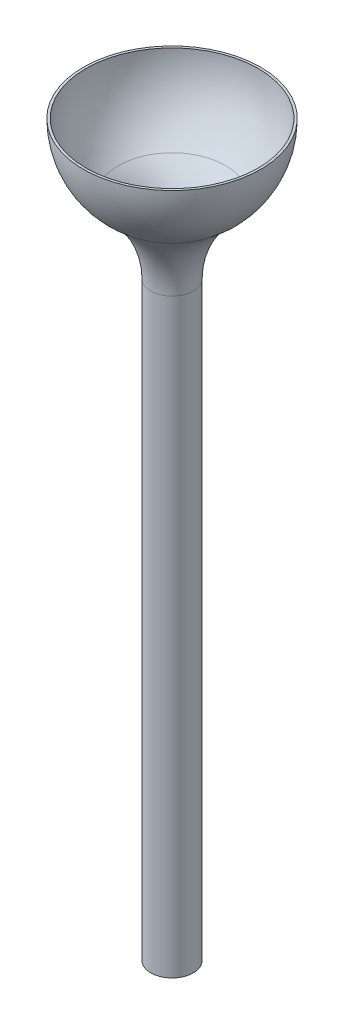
ISO-10303-21;
HEADER;
FILE_DESCRIPTION(('STEP AP214'),'2;1');
FILE_NAME('part.step','',(''),(''),'','','');
FILE_SCHEMA(('AUTOMOTIVE_DESIGN { 1 0 10303 214 1 1 1 1 }'));
ENDSEC;
DATA;
#1=APPLICATION_CONTEXT('core data for automotive mechanical design processes');
#2=APPLICATION_PROTOCOL_DEFINITION('international standard','automotive_design',2000,#1);
#3=PRODUCT_CONTEXT('',#1,'mechanical');
#4=PRODUCT('Part','Part','',(#3));
#5=PRODUCT_RELATED_PRODUCT_CATEGORY('part','',(#4));
#6=PRODUCT_DEFINITION_FORMATION('','',#4);
#7=PRODUCT_DEFINITION_CONTEXT('part definition',#1,'design');
#8=PRODUCT_DEFINITION('design','',#6,#7);
#9=PRODUCT_DEFINITION_SHAPE('','',#8);
#10=(LENGTH_UNIT() NAMED_UNIT(*) SI_UNIT(.MILLI.,.METRE.));
#11=(NAMED_UNIT(*) PLANE_ANGLE_UNIT() SI_UNIT($,.RADIAN.));
#12=(NAMED_UNIT(*) SI_UNIT($,.STERADIAN.) SOLID_ANGLE_UNIT());
#13=UNCERTAINTY_MEASURE_WITH_UNIT(LENGTH_MEASURE(1.E-05),#10,'distance_accuracy_value','');
#14=(GEOMETRIC_REPRESENTATION_CONTEXT(3) GLOBAL_UNCERTAINTY_ASSIGNED_CONTEXT((#13)) GLOBAL_UNIT_ASSIGNED_CONTEXT((#10,
#11,#12)) REPRESENTATION_CONTEXT('',''));
#15=CARTESIAN_POINT('',(0.,0.,0.));
#16=DIRECTION('',(0.,0.,1.));
#17=DIRECTION('',(1.,0.,0.));
#18=AXIS2_PLACEMENT_3D('',#15,#16,#17);
#19=CARTESIAN_POINT('',(0.,61.7690271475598,0.));
#20=DIRECTION('',(0.,1.,0.));
#21=DIRECTION('',(0.,0.,1.));
#22=AXIS2_PLACEMENT_3D('',#19,#20,#21);
#23=PLANE('',#22);
#24=CARTESIAN_POINT('',(0.,61.7690271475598,0.));
#25=DIRECTION('',(0.,-1.,0.));
#26=DIRECTION('',(0.,0.,-1.));
#27=AXIS2_PLACEMENT_3D('',#24,#25,#26);
#28=CIRCLE('',#27,7.3);
#29=CARTESIAN_POINT('',(0.,61.7690271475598,-7.3));
#30=VERTEX_POINT('',#29);
#31=EDGE_CURVE('E52',#30,#30,#28,.T.);
#32=ORIENTED_EDGE('',*,*,#31,.T.);
#33=EDGE_LOOP('',(#32));
#34=FACE_BOUND('',#33,.T.);
#35=CARTESIAN_POINT('',(0.,61.7690271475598,0.));
#36=DIRECTION('',(0.,-1.,0.));
#37=DIRECTION('',(0.,0.,-1.));
#38=AXIS2_PLACEMENT_3D('',#35,#36,#37);
#39=CIRCLE('',#38,7.5);
#40=CARTESIAN_POINT('',(0.,61.7690271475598,-7.5));
#41=VERTEX_POINT('',#40);
#42=EDGE_CURVE('E56',#41,#41,#39,.T.);
#43=ORIENTED_EDGE('',*,*,#42,.F.);
#44=EDGE_LOOP('',(#43));
#45=FACE_BOUND('',#44,.T.);
#46=ADVANCED_FACE('F36',(#34,#45),#23,.T.);
#47=CARTESIAN_POINT('',(0.,0.,0.));
#48=DIRECTION('',(0.,1.,0.));
#49=DIRECTION('',(0.,0.,1.));
#50=AXIS2_PLACEMENT_3D('',#47,#48,#49);
#51=PLANE('',#50);
#52=CARTESIAN_POINT('',(0.,0.,0.));
#53=DIRECTION('',(0.,-1.,0.));
#54=DIRECTION('',(0.,0.,-1.));
#55=AXIS2_PLACEMENT_3D('',#52,#53,#54);
#56=CIRCLE('',#55,1.6);
#57=CARTESIAN_POINT('',(0.,0.,-1.6));
#58=VERTEX_POINT('',#57);
#59=EDGE_CURVE('E10',#58,#58,#56,.T.);
#60=ORIENTED_EDGE('',*,*,#59,.F.);
#61=EDGE_LOOP('',(#60));
#62=FACE_BOUND('',#61,.T.);
#63=CARTESIAN_POINT('',(0.,0.,0.));
#64=DIRECTION('',(0.,-1.,0.));
#65=DIRECTION('',(0.,0.,-1.));
#66=AXIS2_PLACEMENT_3D('',#63,#64,#65);
#67=CIRCLE('',#66,1.8);
#68=CARTESIAN_POINT('',(0.,0.,-1.8));
#69=VERTEX_POINT('',#68);
#70=EDGE_CURVE('E55',#69,#69,#67,.T.);
#71=ORIENTED_EDGE('',*,*,#70,.T.);
#72=EDGE_LOOP('',(#71));
#73=FACE_BOUND('',#72,.T.);
#74=ADVANCED_FACE('F82',(#62,#73),#51,.F.);
#75=CARTESIAN_POINT('',(0.,61.7690271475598,0.));
#76=DIRECTION('',(0.,-1.,0.));
#77=DIRECTION('',(0.,0.,-1.));
#78=AXIS2_PLACEMENT_3D('',#75,#76,#77);
#79=CYLINDRICAL_SURFACE('',#78,1.6);
#80=ORIENTED_EDGE('',*,*,#59,.T.);
#81=EDGE_LOOP('',(#80));
#82=FACE_BOUND('',#81,.T.);
#83=CARTESIAN_POINT('',(0.,50.,0.));
#84=DIRECTION('',(0.,-1.,0.));
#85=DIRECTION('',(0.,0.,-1.));
#86=AXIS2_PLACEMENT_3D('',#83,#84,#85);
#87=CIRCLE('',#86,1.6);
#88=CARTESIAN_POINT('',(0.,50.,-1.6));
#89=VERTEX_POINT('',#88);
#90=EDGE_CURVE('E43',#89,#89,#87,.T.);
#91=ORIENTED_EDGE('',*,*,#90,.F.);
#92=EDGE_LOOP('',(#91));
#93=FACE_BOUND('',#92,.T.);
#94=ADVANCED_FACE('F87',(#82,#93),#79,.F.);
#95=CARTESIAN_POINT('',(0.,50.,0.));
#96=DIRECTION('',(0.,-1.,0.));
#97=DIRECTION('',(0.,0.,-1.));
#98=AXIS2_PLACEMENT_3D('',#95,#96,#97);
#99=TOROIDAL_SURFACE('',#98,9.29999999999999,7.7);
#100=ORIENTED_EDGE('',*,*,#90,.T.);
#101=EDGE_LOOP('',(#100));
#102=FACE_BOUND('',#101,.T.);
#103=CARTESIAN_POINT('',(0.,56.0414339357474,0.));
#104=DIRECTION('',(0.,-1.,0.));
#105=DIRECTION('',(0.,0.,-1.));
#106=AXIS2_PLACEMENT_3D('',#103,#104,#105);
#107=CIRCLE('',#106,4.52599999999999);
#108=CARTESIAN_POINT('',(0.,56.0414339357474,-4.52599999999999));
#109=VERTEX_POINT('',#108);
#110=EDGE_CURVE('E48',#109,#109,#107,.T.);
#111=ORIENTED_EDGE('',*,*,#110,.F.);
#112=EDGE_LOOP('',(#111));
#113=FACE_BOUND('',#112,.T.);
#114=ADVANCED_FACE('F93',(#102,#113),#99,.T.);
#115=CARTESIAN_POINT('',(0.,61.7690271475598,0.));
#116=DIRECTION('',(0.,-1.,0.));
#117=DIRECTION('',(1.,0.,0.));
#118=AXIS2_PLACEMENT_3D('',#115,#116,#117);
#119=SPHERICAL_SURFACE('',#118,7.3);
#120=ORIENTED_EDGE('',*,*,#110,.T.);
#121=EDGE_LOOP('',(#120));
#122=FACE_BOUND('',#121,.T.);
#123=ORIENTED_EDGE('',*,*,#31,.F.);
#124=EDGE_LOOP('',(#123));
#125=FACE_BOUND('',#124,.T.);
#126=ADVANCED_FACE('F91',(#122,#125),#119,.F.);
#127=CARTESIAN_POINT('',(0.,61.7690271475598,0.));
#128=DIRECTION('',(0.,-1.,0.));
#129=DIRECTION('',(0.,0.,-1.));
#130=AXIS2_PLACEMENT_3D('',#127,#128,#129);
#131=CYLINDRICAL_SURFACE('',#130,1.8);
#132=ORIENTED_EDGE('',*,*,#70,.F.);
#133=EDGE_LOOP('',(#132));
#134=FACE_BOUND('',#133,.T.);
#135=CARTESIAN_POINT('',(0.,50.,0.));
#136=DIRECTION('',(0.,-1.,0.));
#137=DIRECTION('',(0.,0.,-1.));
#138=AXIS2_PLACEMENT_3D('',#135,#136,#137);
#139=CIRCLE('',#138,1.79999999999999);
#140=CARTESIAN_POINT('',(0.,50.,-1.79999999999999));
#141=VERTEX_POINT('',#140);
#142=EDGE_CURVE('E39',#141,#141,#139,.T.);
#143=ORIENTED_EDGE('',*,*,#142,.T.);
#144=EDGE_LOOP('',(#143));
#145=FACE_BOUND('',#144,.T.);
#146=ADVANCED_FACE('F67',(#134,#145),#131,.T.);
#147=CARTESIAN_POINT('',(0.,50.,0.));
#148=DIRECTION('',(0.,-1.,0.));
#149=DIRECTION('',(0.,0.,-1.));
#150=AXIS2_PLACEMENT_3D('',#147,#148,#149);
#151=TOROIDAL_SURFACE('',#150,9.29999999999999,7.5);
#152=ORIENTED_EDGE('',*,*,#142,.F.);
#153=EDGE_LOOP('',(#152));
#154=FACE_BOUND('',#153,.T.);
#155=CARTESIAN_POINT('',(0.,55.8845135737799,0.));
#156=DIRECTION('',(0.,-1.,0.));
#157=DIRECTION('',(0.,0.,-1.));
#158=AXIS2_PLACEMENT_3D('',#155,#156,#157);
#159=CIRCLE('',#158,4.65);
#160=CARTESIAN_POINT('',(0.,55.8845135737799,-4.65));
#161=VERTEX_POINT('',#160);
#162=EDGE_CURVE('E59',#161,#161,#159,.T.);
#163=ORIENTED_EDGE('',*,*,#162,.T.);
#164=EDGE_LOOP('',(#163));
#165=FACE_BOUND('',#164,.T.);
#166=ADVANCED_FACE('F69',(#154,#165),#151,.F.);
#167=CARTESIAN_POINT('',(0.,61.7690271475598,0.));
#168=DIRECTION('',(0.,-1.,0.));
#169=DIRECTION('',(1.,0.,0.));
#170=AXIS2_PLACEMENT_3D('',#167,#168,#169);
#171=SPHERICAL_SURFACE('',#170,7.5);
#172=ORIENTED_EDGE('',*,*,#162,.F.);
#173=EDGE_LOOP('',(#172));
#174=FACE_BOUND('',#173,.T.);
#175=ORIENTED_EDGE('',*,*,#42,.T.);
#176=EDGE_LOOP('',(#175));
#177=FACE_BOUND('',#176,.T.);
#178=ADVANCED_FACE('F72',(#174,#177),#171,.T.);
#179=CLOSED_SHELL('',(#46,#74,#94,#114,#126,#146,#166,#178));
#180=MANIFOLD_SOLID_BREP('B2',#179);
#181=ADVANCED_BREP_SHAPE_REPRESENTATION('',(#18,#180),#14);
#182=SHAPE_DEFINITION_REPRESENTATION(#9,#181);
ENDSEC;
END-ISO-10303-21;
